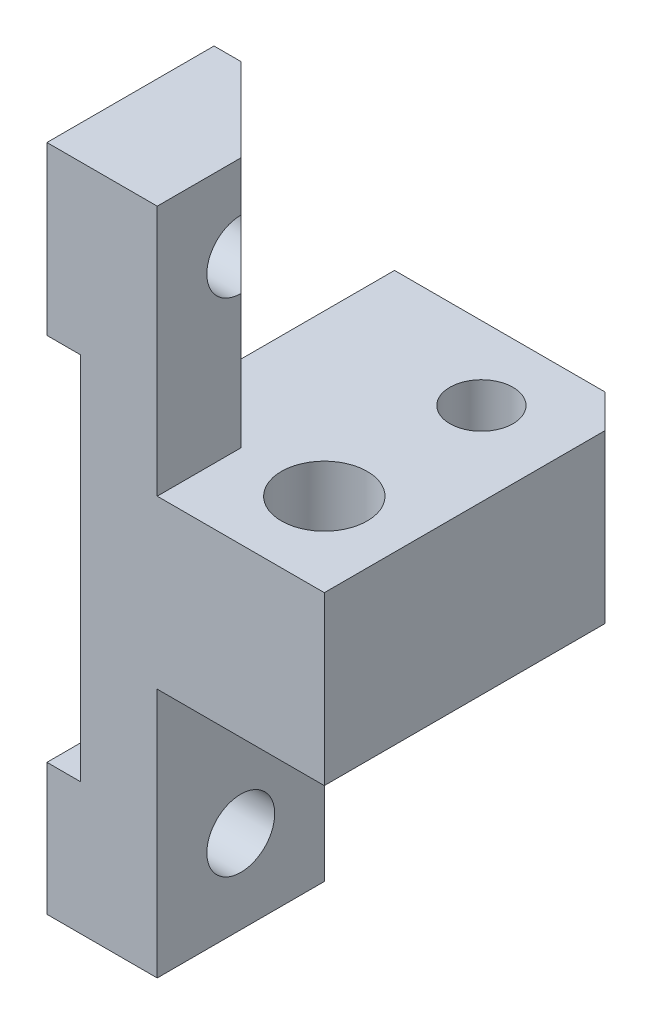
ISO-10303-21;
HEADER;
FILE_DESCRIPTION(('STEP AP214'),'2;1');
FILE_NAME('part.step','',(''),(''),'','','');
FILE_SCHEMA(('AUTOMOTIVE_DESIGN { 1 0 10303 214 1 1 1 1 }'));
ENDSEC;
DATA;
#1=APPLICATION_CONTEXT('core data for automotive mechanical design processes');
#2=APPLICATION_PROTOCOL_DEFINITION('international standard','automotive_design',2000,#1);
#3=PRODUCT_CONTEXT('',#1,'mechanical');
#4=PRODUCT('Part','Part','',(#3));
#5=PRODUCT_RELATED_PRODUCT_CATEGORY('part','',(#4));
#6=PRODUCT_DEFINITION_FORMATION('','',#4);
#7=PRODUCT_DEFINITION_CONTEXT('part definition',#1,'design');
#8=PRODUCT_DEFINITION('design','',#6,#7);
#9=PRODUCT_DEFINITION_SHAPE('','',#8);
#10=(LENGTH_UNIT() NAMED_UNIT(*) SI_UNIT(.MILLI.,.METRE.));
#11=(NAMED_UNIT(*) PLANE_ANGLE_UNIT() SI_UNIT($,.RADIAN.));
#12=(NAMED_UNIT(*) SI_UNIT($,.STERADIAN.) SOLID_ANGLE_UNIT());
#13=UNCERTAINTY_MEASURE_WITH_UNIT(LENGTH_MEASURE(1.E-05),#10,'distance_accuracy_value','');
#14=(GEOMETRIC_REPRESENTATION_CONTEXT(3) GLOBAL_UNCERTAINTY_ASSIGNED_CONTEXT((#13)) GLOBAL_UNIT_ASSIGNED_CONTEXT((#10,
#11,#12)) REPRESENTATION_CONTEXT('',''));
#15=CARTESIAN_POINT('',(0.,0.,0.));
#16=DIRECTION('',(0.,0.,1.));
#17=DIRECTION('',(1.,0.,0.));
#18=AXIS2_PLACEMENT_3D('',#15,#16,#17);
#19=CARTESIAN_POINT('',(0.,-12.7,0.));
#20=DIRECTION('',(0.,0.,1.));
#21=DIRECTION('',(1.,0.,0.));
#22=AXIS2_PLACEMENT_3D('',#19,#20,#21);
#23=PLANE('',#22);
#24=DIRECTION('',(1.,0.,0.));
#25=VECTOR('',#24,1.);
#26=CARTESIAN_POINT('',(0.,6.35,0.));
#27=LINE('',#26,#25);
#28=CARTESIAN_POINT('',(0.,6.35,0.));
#29=VERTEX_POINT('',#28);
#30=CARTESIAN_POINT('',(1.01599999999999,6.35,0.));
#31=VERTEX_POINT('',#30);
#32=EDGE_CURVE('E329',#29,#31,#27,.T.);
#33=ORIENTED_EDGE('',*,*,#32,.F.);
#34=DIRECTION('',(0.,-1.,0.));
#35=VECTOR('',#34,1.);
#36=CARTESIAN_POINT('',(0.,12.7,0.));
#37=LINE('',#36,#35);
#38=CARTESIAN_POINT('',(0.,12.7,0.));
#39=VERTEX_POINT('',#38);
#40=EDGE_CURVE('E216',#39,#29,#37,.T.);
#41=ORIENTED_EDGE('',*,*,#40,.F.);
#42=DIRECTION('',(-1.,0.,0.));
#43=VECTOR('',#42,1.);
#44=CARTESIAN_POINT('',(0.,12.7,0.));
#45=LINE('',#44,#43);
#46=CARTESIAN_POINT('',(1.01599999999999,12.7,0.));
#47=VERTEX_POINT('',#46);
#48=EDGE_CURVE('E189',#47,#39,#45,.T.);
#49=ORIENTED_EDGE('',*,*,#48,.F.);
#50=DIRECTION('',(0.,-1.,0.));
#51=VECTOR('',#50,1.);
#52=CARTESIAN_POINT('',(1.01599999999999,-12.7,0.));
#53=LINE('',#52,#51);
#54=EDGE_CURVE('E265',#47,#31,#53,.T.);
#55=ORIENTED_EDGE('',*,*,#54,.T.);
#56=EDGE_LOOP('',(#33,#41,#49,#55));
#57=FACE_BOUND('',#56,.T.);
#58=ADVANCED_FACE('F42',(#57),#23,.F.);
#59=DIRECTION('',(-1.,0.,0.));
#60=VECTOR('',#59,1.);
#61=CARTESIAN_POINT('',(0.,-7.69743289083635,0.));
#62=LINE('',#61,#60);
#63=CARTESIAN_POINT('',(1.27,-7.69743289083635,0.));
#64=VERTEX_POINT('',#63);
#65=CARTESIAN_POINT('',(0.,-7.69743289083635,0.));
#66=VERTEX_POINT('',#65);
#67=EDGE_CURVE('E170',#64,#66,#62,.T.);
#68=ORIENTED_EDGE('',*,*,#67,.F.);
#69=DIRECTION('',(0.,1.,0.));
#70=VECTOR('',#69,1.);
#71=CARTESIAN_POINT('',(1.27,-12.7,0.));
#72=LINE('',#71,#70);
#73=CARTESIAN_POINT('',(1.27,-3.194174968,0.));
#74=VERTEX_POINT('',#73);
#75=EDGE_CURVE('E327',#64,#74,#72,.T.);
#76=ORIENTED_EDGE('',*,*,#75,.T.);
#77=DIRECTION('',(-1.,0.,0.));
#78=VECTOR('',#77,1.);
#79=CARTESIAN_POINT('',(10.541,-3.194174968,0.));
#80=LINE('',#79,#78);
#81=CARTESIAN_POINT('',(4.191,-3.19417496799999,0.));
#82=VERTEX_POINT('',#81);
#83=EDGE_CURVE('E228',#82,#74,#80,.T.);
#84=ORIENTED_EDGE('',*,*,#83,.F.);
#85=DIRECTION('',(0.,1.,0.));
#86=VECTOR('',#85,1.);
#87=CARTESIAN_POINT('',(4.191,12.7,0.));
#88=LINE('',#87,#86);
#89=CARTESIAN_POINT('',(4.191,-12.7,0.));
#90=VERTEX_POINT('',#89);
#91=EDGE_CURVE('E193',#90,#82,#88,.T.);
#92=ORIENTED_EDGE('',*,*,#91,.F.);
#93=DIRECTION('',(1.,0.,0.));
#94=VECTOR('',#93,1.);
#95=CARTESIAN_POINT('',(0.,-12.7,0.));
#96=LINE('',#95,#94);
#97=CARTESIAN_POINT('',(0.,-12.7,0.));
#98=VERTEX_POINT('',#97);
#99=EDGE_CURVE('E212',#98,#90,#96,.T.);
#100=ORIENTED_EDGE('',*,*,#99,.F.);
#101=EDGE_CURVE('E46',#66,#98,#37,.T.);
#102=ORIENTED_EDGE('',*,*,#101,.F.);
#103=EDGE_LOOP('',(#68,#76,#84,#92,#100,#102));
#104=FACE_BOUND('',#103,.T.);
#105=ADVANCED_FACE('F363',(#104),#23,.F.);
#106=CARTESIAN_POINT('',(0.,12.7,6.35));
#107=DIRECTION('',(1.,0.,0.));
#108=DIRECTION('',(0.,1.,0.));
#109=AXIS2_PLACEMENT_3D('',#106,#107,#108);
#110=PLANE('',#109);
#111=CARTESIAN_POINT('',(0.,-9.525,3.17500000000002));
#112=DIRECTION('',(-1.,0.,0.));
#113=DIRECTION('',(0.,0.,1.));
#114=AXIS2_PLACEMENT_3D('',#111,#112,#113);
#115=CIRCLE('',#114,1.28904999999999);
#116=CARTESIAN_POINT('',(0.,-9.525,4.46405000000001));
#117=VERTEX_POINT('',#116);
#118=EDGE_CURVE('E334',#117,#117,#115,.T.);
#119=ORIENTED_EDGE('',*,*,#118,.F.);
#120=EDGE_LOOP('',(#119));
#121=FACE_BOUND('',#120,.T.);
#122=DIRECTION('',(0.,0.,-1.));
#123=VECTOR('',#122,1.);
#124=CARTESIAN_POINT('',(0.,-7.69743289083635,6.35));
#125=LINE('',#124,#123);
#126=CARTESIAN_POINT('',(0.,-7.69743289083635,6.35));
#127=VERTEX_POINT('',#126);
#128=EDGE_CURVE('E163',#127,#66,#125,.T.);
#129=ORIENTED_EDGE('',*,*,#128,.T.);
#130=ORIENTED_EDGE('',*,*,#101,.T.);
#131=DIRECTION('',(0.,0.,-1.));
#132=VECTOR('',#131,1.);
#133=CARTESIAN_POINT('',(0.,-12.7,6.35));
#134=LINE('',#133,#132);
#135=CARTESIAN_POINT('',(0.,-12.7,6.35));
#136=VERTEX_POINT('',#135);
#137=EDGE_CURVE('E187',#136,#98,#134,.T.);
#138=ORIENTED_EDGE('',*,*,#137,.F.);
#139=DIRECTION('',(0.,-1.,0.));
#140=VECTOR('',#139,1.);
#141=CARTESIAN_POINT('',(0.,12.7,6.35));
#142=LINE('',#141,#140);
#143=EDGE_CURVE('E178',#127,#136,#142,.T.);
#144=ORIENTED_EDGE('',*,*,#143,.F.);
#145=EDGE_LOOP('',(#129,#130,#138,#144));
#146=FACE_BOUND('',#145,.T.);
#147=ADVANCED_FACE('F44',(#121,#146),#110,.F.);
#148=CARTESIAN_POINT('',(0.,9.525,3.17500000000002));
#149=DIRECTION('',(-1.,0.,0.));
#150=DIRECTION('',(0.,0.,1.));
#151=AXIS2_PLACEMENT_3D('',#148,#149,#150);
#152=CIRCLE('',#151,1.28904999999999);
#153=CARTESIAN_POINT('',(0.,9.525,4.46405));
#154=VERTEX_POINT('',#153);
#155=EDGE_CURVE('E340',#154,#154,#152,.T.);
#156=ORIENTED_EDGE('',*,*,#155,.F.);
#157=EDGE_LOOP('',(#156));
#158=FACE_BOUND('',#157,.T.);
#159=DIRECTION('',(0.,0.,1.));
#160=VECTOR('',#159,1.);
#161=CARTESIAN_POINT('',(0.,6.35,6.35));
#162=LINE('',#161,#160);
#163=CARTESIAN_POINT('',(0.,6.35,6.35));
#164=VERTEX_POINT('',#163);
#165=EDGE_CURVE('E174',#29,#164,#162,.T.);
#166=ORIENTED_EDGE('',*,*,#165,.T.);
#167=CARTESIAN_POINT('',(0.,12.7,6.35));
#168=VERTEX_POINT('',#167);
#169=EDGE_CURVE('E188',#168,#164,#142,.T.);
#170=ORIENTED_EDGE('',*,*,#169,.F.);
#171=DIRECTION('',(0.,0.,-1.));
#172=VECTOR('',#171,1.);
#173=CARTESIAN_POINT('',(0.,12.7,6.35));
#174=LINE('',#173,#172);
#175=EDGE_CURVE('E416',#168,#39,#174,.T.);
#176=ORIENTED_EDGE('',*,*,#175,.T.);
#177=ORIENTED_EDGE('',*,*,#40,.T.);
#178=EDGE_LOOP('',(#166,#170,#176,#177));
#179=FACE_BOUND('',#178,.T.);
#180=ADVANCED_FACE('F376',(#158,#179),#110,.F.);
#181=CARTESIAN_POINT('',(0.,-12.7,6.35));
#182=DIRECTION('',(0.,0.,1.));
#183=DIRECTION('',(1.,0.,0.));
#184=AXIS2_PLACEMENT_3D('',#181,#182,#183);
#185=PLANE('',#184);
#186=DIRECTION('',(0.,-1.,0.));
#187=VECTOR('',#186,1.);
#188=CARTESIAN_POINT('',(1.27,6.35,6.35));
#189=LINE('',#188,#187);
#190=CARTESIAN_POINT('',(1.27,6.35,6.35));
#191=VERTEX_POINT('',#190);
#192=CARTESIAN_POINT('',(1.27,-7.69743289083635,6.35));
#193=VERTEX_POINT('',#192);
#194=EDGE_CURVE('E181',#191,#193,#189,.T.);
#195=ORIENTED_EDGE('',*,*,#194,.T.);
#196=DIRECTION('',(-1.,0.,0.));
#197=VECTOR('',#196,1.);
#198=CARTESIAN_POINT('',(1.27,-7.69743289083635,6.35));
#199=LINE('',#198,#197);
#200=EDGE_CURVE('E167',#193,#127,#199,.T.);
#201=ORIENTED_EDGE('',*,*,#200,.T.);
#202=ORIENTED_EDGE('',*,*,#143,.T.);
#203=DIRECTION('',(1.,0.,0.));
#204=VECTOR('',#203,1.);
#205=CARTESIAN_POINT('',(0.,-12.7,6.35));
#206=LINE('',#205,#204);
#207=CARTESIAN_POINT('',(4.191,-12.7,6.35));
#208=VERTEX_POINT('',#207);
#209=EDGE_CURVE('E192',#136,#208,#206,.T.);
#210=ORIENTED_EDGE('',*,*,#209,.T.);
#211=DIRECTION('',(0.,1.,0.));
#212=VECTOR('',#211,1.);
#213=CARTESIAN_POINT('',(4.191,12.7,6.35));
#214=LINE('',#213,#212);
#215=CARTESIAN_POINT('',(4.191,-3.19417496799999,6.35));
#216=VERTEX_POINT('',#215);
#217=EDGE_CURVE('E207',#208,#216,#214,.T.);
#218=ORIENTED_EDGE('',*,*,#217,.T.);
#219=DIRECTION('',(-1.,0.,0.));
#220=VECTOR('',#219,1.);
#221=CARTESIAN_POINT('',(10.541,-3.194174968,6.35));
#222=LINE('',#221,#220);
#223=CARTESIAN_POINT('',(10.541,-3.194174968,6.35));
#224=VERTEX_POINT('',#223);
#225=EDGE_CURVE('E298',#224,#216,#222,.T.);
#226=ORIENTED_EDGE('',*,*,#225,.F.);
#227=DIRECTION('',(0.,-1.,0.));
#228=VECTOR('',#227,1.);
#229=CARTESIAN_POINT('',(10.541,-3.194174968,6.35));
#230=LINE('',#229,#228);
#231=CARTESIAN_POINT('',(10.541,3.155825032,6.35));
#232=VERTEX_POINT('',#231);
#233=EDGE_CURVE('E300',#232,#224,#230,.T.);
#234=ORIENTED_EDGE('',*,*,#233,.F.);
#235=DIRECTION('',(-1.,0.,0.));
#236=VECTOR('',#235,1.);
#237=CARTESIAN_POINT('',(10.541,3.155825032,6.35));
#238=LINE('',#237,#236);
#239=CARTESIAN_POINT('',(4.191,3.155825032,6.35));
#240=VERTEX_POINT('',#239);
#241=EDGE_CURVE('E294',#232,#240,#238,.T.);
#242=ORIENTED_EDGE('',*,*,#241,.T.);
#243=CARTESIAN_POINT('',(4.191,12.7,6.35));
#244=VERTEX_POINT('',#243);
#245=EDGE_CURVE('E198',#240,#244,#214,.T.);
#246=ORIENTED_EDGE('',*,*,#245,.T.);
#247=DIRECTION('',(-1.,0.,0.));
#248=VECTOR('',#247,1.);
#249=CARTESIAN_POINT('',(0.,12.7,6.35));
#250=LINE('',#249,#248);
#251=EDGE_CURVE('E201',#244,#168,#250,.T.);
#252=ORIENTED_EDGE('',*,*,#251,.T.);
#253=ORIENTED_EDGE('',*,*,#169,.T.);
#254=DIRECTION('',(-1.,0.,0.));
#255=VECTOR('',#254,1.);
#256=CARTESIAN_POINT('',(1.27,6.35,6.35));
#257=LINE('',#256,#255);
#258=EDGE_CURVE('E183',#191,#164,#257,.T.);
#259=ORIENTED_EDGE('',*,*,#258,.F.);
#260=EDGE_LOOP('',(#195,#201,#202,#210,#218,#226,#234,#242,#246,#252,#253,#259));
#261=FACE_BOUND('',#260,.T.);
#262=ADVANCED_FACE('F177',(#261),#185,.T.);
#263=CARTESIAN_POINT('',(4.191,12.7,3.175));
#264=DIRECTION('',(-0.707106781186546,0.,0.707106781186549));
#265=DIRECTION('',(0.707106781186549,0.,0.707106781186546));
#266=AXIS2_PLACEMENT_3D('',#263,#264,#265);
#267=PLANE('',#266);
#268=DIRECTION('',(0.,1.,0.));
#269=VECTOR('',#268,1.);
#270=CARTESIAN_POINT('',(1.27,12.7,0.254000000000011));
#271=LINE('',#270,#269);
#272=CARTESIAN_POINT('',(1.27,6.35,0.254000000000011));
#273=VERTEX_POINT('',#272);
#274=CARTESIAN_POINT('',(1.27,3.155825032,0.254000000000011));
#275=VERTEX_POINT('',#274);
#276=EDGE_CURVE('E52',#273,#275,#271,.F.);
#277=ORIENTED_EDGE('',*,*,#276,.F.);
#278=DIRECTION('',(0.707106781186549,0.,0.707106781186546));
#279=VECTOR('',#278,1.);
#280=CARTESIAN_POINT('',(4.191,6.35,3.175));
#281=LINE('',#280,#279);
#282=EDGE_CURVE('E13',#273,#31,#281,.F.);
#283=ORIENTED_EDGE('',*,*,#282,.T.);
#284=ORIENTED_EDGE('',*,*,#54,.F.);
#285=DIRECTION('',(0.707106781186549,0.,0.707106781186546));
#286=VECTOR('',#285,1.);
#287=CARTESIAN_POINT('',(4.191,12.7,3.175));
#288=LINE('',#287,#286);
#289=CARTESIAN_POINT('',(4.191,12.7,3.175));
#290=VERTEX_POINT('',#289);
#291=EDGE_CURVE('E262',#290,#47,#288,.F.);
#292=ORIENTED_EDGE('',*,*,#291,.F.);
#293=DIRECTION('',(0.,1.,0.));
#294=VECTOR('',#293,1.);
#295=CARTESIAN_POINT('',(4.191,12.7,3.175));
#296=LINE('',#295,#294);
#297=CARTESIAN_POINT('',(4.191,10.81405,3.175));
#298=VERTEX_POINT('',#297);
#299=EDGE_CURVE('E263',#298,#290,#296,.T.);
#300=ORIENTED_EDGE('',*,*,#299,.F.);
#301=CARTESIAN_POINT('',(4.19100000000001,9.525,3.17500000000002));
#302=DIRECTION('',(-0.707106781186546,0.,0.707106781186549));
#303=DIRECTION('',(-0.707106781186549,0.,-0.707106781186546));
#304=AXIS2_PLACEMENT_3D('',#301,#302,#303);
#305=ELLIPSE('',#304,1.82299199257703,1.28904999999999);
#306=CARTESIAN_POINT('',(4.191,8.23595000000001,3.175));
#307=VERTEX_POINT('',#306);
#308=EDGE_CURVE('E286',#307,#298,#305,.F.);
#309=ORIENTED_EDGE('',*,*,#308,.F.);
#310=CARTESIAN_POINT('',(4.191,3.155825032,3.175));
#311=VERTEX_POINT('',#310);
#312=EDGE_CURVE('E259',#311,#307,#296,.T.);
#313=ORIENTED_EDGE('',*,*,#312,.F.);
#314=DIRECTION('',(-0.707106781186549,0.,-0.707106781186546));
#315=VECTOR('',#314,1.);
#316=CARTESIAN_POINT('',(5.77850000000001,3.155825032,4.7625));
#317=LINE('',#316,#315);
#318=EDGE_CURVE('E268',#275,#311,#317,.F.);
#319=ORIENTED_EDGE('',*,*,#318,.F.);
#320=EDGE_LOOP('',(#277,#283,#284,#292,#300,#309,#313,#319));
#321=FACE_BOUND('',#320,.T.);
#322=ADVANCED_FACE('F284',(#321),#267,.F.);
#323=CARTESIAN_POINT('',(4.191,12.7,6.35));
#324=DIRECTION('',(-1.,0.,0.));
#325=DIRECTION('',(0.,-1.,0.));
#326=AXIS2_PLACEMENT_3D('',#323,#324,#325);
#327=PLANE('',#326);
#328=CARTESIAN_POINT('',(4.191,-9.525,3.17500000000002));
#329=DIRECTION('',(-1.,0.,0.));
#330=DIRECTION('',(0.,-1.,0.));
#331=AXIS2_PLACEMENT_3D('',#328,#329,#330);
#332=CIRCLE('',#331,1.28904999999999);
#333=CARTESIAN_POINT('',(4.191,-10.81405,3.17500000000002));
#334=VERTEX_POINT('',#333);
#335=EDGE_CURVE('E337',#334,#334,#332,.T.);
#336=ORIENTED_EDGE('',*,*,#335,.T.);
#337=EDGE_LOOP('',(#336));
#338=FACE_BOUND('',#337,.T.);
#339=DIRECTION('',(0.,0.,-1.));
#340=VECTOR('',#339,1.);
#341=CARTESIAN_POINT('',(4.191,-3.194174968,0.));
#342=LINE('',#341,#340);
#343=EDGE_CURVE('E256',#216,#82,#342,.T.);
#344=ORIENTED_EDGE('',*,*,#343,.F.);
#345=ORIENTED_EDGE('',*,*,#217,.F.);
#346=DIRECTION('',(0.,0.,-1.));
#347=VECTOR('',#346,1.);
#348=CARTESIAN_POINT('',(4.191,-12.7,6.35));
#349=LINE('',#348,#347);
#350=EDGE_CURVE('E393',#208,#90,#349,.T.);
#351=ORIENTED_EDGE('',*,*,#350,.T.);
#352=ORIENTED_EDGE('',*,*,#91,.T.);
#353=EDGE_LOOP('',(#344,#345,#351,#352));
#354=FACE_BOUND('',#353,.T.);
#355=ADVANCED_FACE('F382',(#338,#354),#327,.F.);
#356=ORIENTED_EDGE('',*,*,#312,.T.);
#357=CARTESIAN_POINT('',(4.191,9.525,3.17500000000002));
#358=DIRECTION('',(-1.,0.,0.));
#359=DIRECTION('',(0.,-1.,0.));
#360=AXIS2_PLACEMENT_3D('',#357,#358,#359);
#361=CIRCLE('',#360,1.28904999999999);
#362=EDGE_CURVE('E66',#307,#298,#361,.T.);
#363=ORIENTED_EDGE('',*,*,#362,.T.);
#364=ORIENTED_EDGE('',*,*,#299,.T.);
#365=DIRECTION('',(0.,0.,-1.));
#366=VECTOR('',#365,1.);
#367=CARTESIAN_POINT('',(4.191,12.7,6.35));
#368=LINE('',#367,#366);
#369=EDGE_CURVE('E397',#244,#290,#368,.T.);
#370=ORIENTED_EDGE('',*,*,#369,.F.);
#371=ORIENTED_EDGE('',*,*,#245,.F.);
#372=DIRECTION('',(0.,0.,1.));
#373=VECTOR('',#372,1.);
#374=CARTESIAN_POINT('',(4.191,3.155825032,0.));
#375=LINE('',#374,#373);
#376=EDGE_CURVE('E253',#311,#240,#375,.T.);
#377=ORIENTED_EDGE('',*,*,#376,.F.);
#378=EDGE_LOOP('',(#356,#363,#364,#370,#371,#377));
#379=FACE_BOUND('',#378,.T.);
#380=ADVANCED_FACE('F288',(#379),#327,.F.);
#381=CARTESIAN_POINT('',(0.,-12.7,6.35));
#382=DIRECTION('',(0.,1.,0.));
#383=DIRECTION('',(0.,0.,1.));
#384=AXIS2_PLACEMENT_3D('',#381,#382,#383);
#385=PLANE('',#384);
#386=ORIENTED_EDGE('',*,*,#99,.T.);
#387=ORIENTED_EDGE('',*,*,#350,.F.);
#388=ORIENTED_EDGE('',*,*,#209,.F.);
#389=ORIENTED_EDGE('',*,*,#137,.T.);
#390=EDGE_LOOP('',(#386,#387,#388,#389));
#391=FACE_BOUND('',#390,.T.);
#392=ADVANCED_FACE('F380',(#391),#385,.F.);
#393=CARTESIAN_POINT('',(0.,12.7,6.35));
#394=DIRECTION('',(0.,-1.,0.));
#395=DIRECTION('',(1.,0.,0.));
#396=AXIS2_PLACEMENT_3D('',#393,#394,#395);
#397=PLANE('',#396);
#398=ORIENTED_EDGE('',*,*,#369,.T.);
#399=ORIENTED_EDGE('',*,*,#291,.T.);
#400=ORIENTED_EDGE('',*,*,#48,.T.);
#401=ORIENTED_EDGE('',*,*,#175,.F.);
#402=ORIENTED_EDGE('',*,*,#251,.F.);
#403=EDGE_LOOP('',(#398,#399,#400,#401,#402));
#404=FACE_BOUND('',#403,.T.);
#405=ADVANCED_FACE('F377',(#404),#397,.F.);
#406=CARTESIAN_POINT('',(10.541,3.155825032,0.));
#407=DIRECTION('',(0.,-1.,0.));
#408=DIRECTION('',(1.,0.,0.));
#409=AXIS2_PLACEMENT_3D('',#406,#407,#408);
#410=PLANE('',#409);
#411=CARTESIAN_POINT('',(7.366,3.155825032,-2.794));
#412=DIRECTION('',(0.,1.,0.));
#413=DIRECTION('',(0.,0.,1.));
#414=AXIS2_PLACEMENT_3D('',#411,#412,#413);
#415=CIRCLE('',#414,1.20015);
#416=CARTESIAN_POINT('',(7.366,3.155825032,-1.59385));
#417=VERTEX_POINT('',#416);
#418=EDGE_CURVE('E238',#417,#417,#415,.T.);
#419=ORIENTED_EDGE('',*,*,#418,.F.);
#420=EDGE_LOOP('',(#419));
#421=FACE_BOUND('',#420,.T.);
#422=CARTESIAN_POINT('',(7.366,3.155825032,3.175));
#423=DIRECTION('',(0.,1.,0.));
#424=DIRECTION('',(0.,0.,1.));
#425=AXIS2_PLACEMENT_3D('',#422,#423,#424);
#426=CIRCLE('',#425,1.63194999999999);
#427=CARTESIAN_POINT('',(7.366,3.155825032,4.80694999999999));
#428=VERTEX_POINT('',#427);
#429=EDGE_CURVE('E245',#428,#428,#426,.T.);
#430=ORIENTED_EDGE('',*,*,#429,.F.);
#431=EDGE_LOOP('',(#430));
#432=FACE_BOUND('',#431,.T.);
#433=DIRECTION('',(1.,0.,0.));
#434=VECTOR('',#433,1.);
#435=CARTESIAN_POINT('',(10.541,3.155825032,-5.588));
#436=LINE('',#435,#434);
#437=CARTESIAN_POINT('',(1.27,3.155825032,-5.588));
#438=VERTEX_POINT('',#437);
#439=CARTESIAN_POINT('',(9.271,3.155825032,-5.588));
#440=VERTEX_POINT('',#439);
#441=EDGE_CURVE('E243',#438,#440,#436,.T.);
#442=ORIENTED_EDGE('',*,*,#441,.F.);
#443=DIRECTION('',(0.,0.,1.));
#444=VECTOR('',#443,1.);
#445=CARTESIAN_POINT('',(1.27,3.155825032,0.));
#446=LINE('',#445,#444);
#447=EDGE_CURVE('E182',#438,#275,#446,.T.);
#448=ORIENTED_EDGE('',*,*,#447,.T.);
#449=ORIENTED_EDGE('',*,*,#318,.T.);
#450=ORIENTED_EDGE('',*,*,#376,.T.);
#451=ORIENTED_EDGE('',*,*,#241,.F.);
#452=DIRECTION('',(0.,0.,1.));
#453=VECTOR('',#452,1.);
#454=CARTESIAN_POINT('',(10.541,3.155825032,0.));
#455=LINE('',#454,#453);
#456=CARTESIAN_POINT('',(10.541,3.155825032,-4.318));
#457=VERTEX_POINT('',#456);
#458=EDGE_CURVE('E296',#457,#232,#455,.T.);
#459=ORIENTED_EDGE('',*,*,#458,.F.);
#460=DIRECTION('',(0.707106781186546,0.,0.707106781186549));
#461=VECTOR('',#460,1.);
#462=CARTESIAN_POINT('',(9.271,3.155825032,-5.588));
#463=LINE('',#462,#461);
#464=EDGE_CURVE('E257',#457,#440,#463,.F.);
#465=ORIENTED_EDGE('',*,*,#464,.T.);
#466=EDGE_LOOP('',(#442,#448,#449,#450,#451,#459,#465));
#467=FACE_BOUND('',#466,.T.);
#468=ADVANCED_FACE('F278',(#421,#432,#467),#410,.F.);
#469=CARTESIAN_POINT('',(10.541,-3.194174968,0.));
#470=DIRECTION('',(0.,1.,0.));
#471=DIRECTION('',(-1.,0.,0.));
#472=AXIS2_PLACEMENT_3D('',#469,#470,#471);
#473=PLANE('',#472);
#474=CARTESIAN_POINT('',(7.366,-3.194174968,-2.794));
#475=DIRECTION('',(0.,1.,0.));
#476=DIRECTION('',(-1.,0.,0.));
#477=AXIS2_PLACEMENT_3D('',#474,#475,#476);
#478=CIRCLE('',#477,1.20015);
#479=CARTESIAN_POINT('',(6.16585,-3.194174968,-2.794));
#480=VERTEX_POINT('',#479);
#481=EDGE_CURVE('E233',#480,#480,#478,.T.);
#482=ORIENTED_EDGE('',*,*,#481,.T.);
#483=EDGE_LOOP('',(#482));
#484=FACE_BOUND('',#483,.T.);
#485=CARTESIAN_POINT('',(7.366,-3.194174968,3.175));
#486=DIRECTION('',(0.,1.,0.));
#487=DIRECTION('',(-1.,0.,0.));
#488=AXIS2_PLACEMENT_3D('',#485,#486,#487);
#489=CIRCLE('',#488,1.63194999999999);
#490=CARTESIAN_POINT('',(5.73405000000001,-3.194174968,3.175));
#491=VERTEX_POINT('',#490);
#492=EDGE_CURVE('E226',#491,#491,#489,.T.);
#493=ORIENTED_EDGE('',*,*,#492,.T.);
#494=EDGE_LOOP('',(#493));
#495=FACE_BOUND('',#494,.T.);
#496=ORIENTED_EDGE('',*,*,#83,.T.);
#497=DIRECTION('',(0.,0.,-1.));
#498=VECTOR('',#497,1.);
#499=CARTESIAN_POINT('',(1.27,-3.194174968,0.));
#500=LINE('',#499,#498);
#501=CARTESIAN_POINT('',(1.27,-3.194174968,-5.588));
#502=VERTEX_POINT('',#501);
#503=EDGE_CURVE('E281',#74,#502,#500,.T.);
#504=ORIENTED_EDGE('',*,*,#503,.T.);
#505=DIRECTION('',(-1.,0.,0.));
#506=VECTOR('',#505,1.);
#507=CARTESIAN_POINT('',(10.541,-3.194174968,-5.588));
#508=LINE('',#507,#506);
#509=CARTESIAN_POINT('',(9.271,-3.194174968,-5.588));
#510=VERTEX_POINT('',#509);
#511=EDGE_CURVE('E240',#510,#502,#508,.T.);
#512=ORIENTED_EDGE('',*,*,#511,.F.);
#513=DIRECTION('',(-0.707106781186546,0.,-0.707106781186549));
#514=VECTOR('',#513,1.);
#515=CARTESIAN_POINT('',(9.271,-3.194174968,-5.588));
#516=LINE('',#515,#514);
#517=CARTESIAN_POINT('',(10.541,-3.194174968,-4.318));
#518=VERTEX_POINT('',#517);
#519=EDGE_CURVE('E314',#510,#518,#516,.F.);
#520=ORIENTED_EDGE('',*,*,#519,.T.);
#521=DIRECTION('',(0.,0.,-1.));
#522=VECTOR('',#521,1.);
#523=CARTESIAN_POINT('',(10.541,-3.194174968,0.));
#524=LINE('',#523,#522);
#525=EDGE_CURVE('E219',#224,#518,#524,.T.);
#526=ORIENTED_EDGE('',*,*,#525,.F.);
#527=ORIENTED_EDGE('',*,*,#225,.T.);
#528=ORIENTED_EDGE('',*,*,#343,.T.);
#529=EDGE_LOOP('',(#496,#504,#512,#520,#526,#527,#528));
#530=FACE_BOUND('',#529,.T.);
#531=ADVANCED_FACE('F312',(#484,#495,#530),#473,.F.);
#532=CARTESIAN_POINT('',(10.541,3.155825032,0.));
#533=DIRECTION('',(1.,0.,0.));
#534=DIRECTION('',(0.,1.,0.));
#535=AXIS2_PLACEMENT_3D('',#532,#533,#534);
#536=PLANE('',#535);
#537=ORIENTED_EDGE('',*,*,#525,.T.);
#538=DIRECTION('',(0.,1.,0.));
#539=VECTOR('',#538,1.);
#540=CARTESIAN_POINT('',(10.541,3.155825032,-4.318));
#541=LINE('',#540,#539);
#542=EDGE_CURVE('E317',#518,#457,#541,.T.);
#543=ORIENTED_EDGE('',*,*,#542,.T.);
#544=ORIENTED_EDGE('',*,*,#458,.T.);
#545=ORIENTED_EDGE('',*,*,#233,.T.);
#546=EDGE_LOOP('',(#537,#543,#544,#545));
#547=FACE_BOUND('',#546,.T.);
#548=ADVANCED_FACE('F316',(#547),#536,.T.);
#549=CARTESIAN_POINT('',(7.366,3.155825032,3.175));
#550=DIRECTION('',(0.,1.,0.));
#551=DIRECTION('',(0.,0.,1.));
#552=AXIS2_PLACEMENT_3D('',#549,#550,#551);
#553=CYLINDRICAL_SURFACE('',#552,1.63194999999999);
#554=ORIENTED_EDGE('',*,*,#429,.T.);
#555=EDGE_LOOP('',(#554));
#556=FACE_BOUND('',#555,.T.);
#557=ORIENTED_EDGE('',*,*,#492,.F.);
#558=EDGE_LOOP('',(#557));
#559=FACE_BOUND('',#558,.T.);
#560=ADVANCED_FACE('F360',(#556,#559),#553,.F.);
#561=CARTESIAN_POINT('',(10.541,-3.194174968,-5.588));
#562=DIRECTION('',(0.,0.,-1.));
#563=DIRECTION('',(-1.,0.,0.));
#564=AXIS2_PLACEMENT_3D('',#561,#562,#563);
#565=PLANE('',#564);
#566=DIRECTION('',(0.,1.,0.));
#567=VECTOR('',#566,1.);
#568=CARTESIAN_POINT('',(1.27,6.35,-5.588));
#569=LINE('',#568,#567);
#570=EDGE_CURVE('E399',#502,#438,#569,.T.);
#571=ORIENTED_EDGE('',*,*,#570,.T.);
#572=ORIENTED_EDGE('',*,*,#441,.T.);
#573=DIRECTION('',(0.,-1.,0.));
#574=VECTOR('',#573,1.);
#575=CARTESIAN_POINT('',(9.271,-3.194174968,-5.588));
#576=LINE('',#575,#574);
#577=EDGE_CURVE('E232',#440,#510,#576,.T.);
#578=ORIENTED_EDGE('',*,*,#577,.T.);
#579=ORIENTED_EDGE('',*,*,#511,.T.);
#580=EDGE_LOOP('',(#571,#572,#578,#579));
#581=FACE_BOUND('',#580,.T.);
#582=ADVANCED_FACE('F324',(#581),#565,.T.);
#583=CARTESIAN_POINT('',(7.366,3.155825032,-2.794));
#584=DIRECTION('',(0.,1.,0.));
#585=DIRECTION('',(0.,0.,1.));
#586=AXIS2_PLACEMENT_3D('',#583,#584,#585);
#587=CYLINDRICAL_SURFACE('',#586,1.20015);
#588=ORIENTED_EDGE('',*,*,#418,.T.);
#589=EDGE_LOOP('',(#588));
#590=FACE_BOUND('',#589,.T.);
#591=ORIENTED_EDGE('',*,*,#481,.F.);
#592=EDGE_LOOP('',(#591));
#593=FACE_BOUND('',#592,.T.);
#594=ADVANCED_FACE('F351',(#590,#593),#587,.F.);
#595=CARTESIAN_POINT('',(9.271,-3.194174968,-5.588));
#596=DIRECTION('',(-0.707106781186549,0.,0.707106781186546));
#597=DIRECTION('',(0.707106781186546,0.,0.707106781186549));
#598=AXIS2_PLACEMENT_3D('',#595,#596,#597);
#599=PLANE('',#598);
#600=ORIENTED_EDGE('',*,*,#464,.F.);
#601=ORIENTED_EDGE('',*,*,#542,.F.);
#602=ORIENTED_EDGE('',*,*,#519,.F.);
#603=ORIENTED_EDGE('',*,*,#577,.F.);
#604=EDGE_LOOP('',(#600,#601,#602,#603));
#605=FACE_BOUND('',#604,.T.);
#606=ADVANCED_FACE('F319',(#605),#599,.F.);
#607=CARTESIAN_POINT('',(0.,9.525,3.17500000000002));
#608=DIRECTION('',(-1.,0.,0.));
#609=DIRECTION('',(0.,0.,1.));
#610=AXIS2_PLACEMENT_3D('',#607,#608,#609);
#611=CYLINDRICAL_SURFACE('',#610,1.28904999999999);
#612=ORIENTED_EDGE('',*,*,#155,.T.);
#613=EDGE_LOOP('',(#612));
#614=FACE_BOUND('',#613,.T.);
#615=ORIENTED_EDGE('',*,*,#308,.T.);
#616=ORIENTED_EDGE('',*,*,#362,.F.);
#617=EDGE_LOOP('',(#615,#616));
#618=FACE_BOUND('',#617,.T.);
#619=ADVANCED_FACE('F358',(#614,#618),#611,.F.);
#620=CARTESIAN_POINT('',(0.,-9.525,3.17500000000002));
#621=DIRECTION('',(-1.,0.,0.));
#622=DIRECTION('',(0.,0.,1.));
#623=AXIS2_PLACEMENT_3D('',#620,#621,#622);
#624=CYLINDRICAL_SURFACE('',#623,1.28904999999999);
#625=ORIENTED_EDGE('',*,*,#118,.T.);
#626=EDGE_LOOP('',(#625));
#627=FACE_BOUND('',#626,.T.);
#628=ORIENTED_EDGE('',*,*,#335,.F.);
#629=EDGE_LOOP('',(#628));
#630=FACE_BOUND('',#629,.T.);
#631=ADVANCED_FACE('F430',(#627,#630),#624,.F.);
#632=CARTESIAN_POINT('',(1.27,-7.69743289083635,6.35));
#633=DIRECTION('',(0.,1.,0.));
#634=DIRECTION('',(-1.,0.,0.));
#635=AXIS2_PLACEMENT_3D('',#632,#633,#634);
#636=PLANE('',#635);
#637=ORIENTED_EDGE('',*,*,#67,.T.);
#638=ORIENTED_EDGE('',*,*,#128,.F.);
#639=ORIENTED_EDGE('',*,*,#200,.F.);
#640=DIRECTION('',(0.,0.,-1.));
#641=VECTOR('',#640,1.);
#642=CARTESIAN_POINT('',(1.27,-7.69743289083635,6.35));
#643=LINE('',#642,#641);
#644=EDGE_CURVE('E398',#193,#64,#643,.T.);
#645=ORIENTED_EDGE('',*,*,#644,.T.);
#646=EDGE_LOOP('',(#637,#638,#639,#645));
#647=FACE_BOUND('',#646,.T.);
#648=ADVANCED_FACE('F165',(#647),#636,.T.);
#649=CARTESIAN_POINT('',(1.27,6.35,6.35));
#650=DIRECTION('',(0.,-1.,0.));
#651=DIRECTION('',(1.,0.,0.));
#652=AXIS2_PLACEMENT_3D('',#649,#650,#651);
#653=PLANE('',#652);
#654=ORIENTED_EDGE('',*,*,#32,.T.);
#655=ORIENTED_EDGE('',*,*,#282,.F.);
#656=DIRECTION('',(0.,0.,1.));
#657=VECTOR('',#656,1.);
#658=CARTESIAN_POINT('',(1.27,6.35,6.35));
#659=LINE('',#658,#657);
#660=EDGE_CURVE('E59',#273,#191,#659,.T.);
#661=ORIENTED_EDGE('',*,*,#660,.T.);
#662=ORIENTED_EDGE('',*,*,#258,.T.);
#663=ORIENTED_EDGE('',*,*,#165,.F.);
#664=EDGE_LOOP('',(#654,#655,#661,#662,#663));
#665=FACE_BOUND('',#664,.T.);
#666=ADVANCED_FACE('F408',(#665),#653,.T.);
#667=CARTESIAN_POINT('',(1.27,-7.69743289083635,6.35));
#668=DIRECTION('',(1.,0.,0.));
#669=DIRECTION('',(0.,1.,0.));
#670=AXIS2_PLACEMENT_3D('',#667,#668,#669);
#671=PLANE('',#670);
#672=ORIENTED_EDGE('',*,*,#644,.F.);
#673=ORIENTED_EDGE('',*,*,#194,.F.);
#674=ORIENTED_EDGE('',*,*,#660,.F.);
#675=ORIENTED_EDGE('',*,*,#276,.T.);
#676=ORIENTED_EDGE('',*,*,#447,.F.);
#677=ORIENTED_EDGE('',*,*,#570,.F.);
#678=ORIENTED_EDGE('',*,*,#503,.F.);
#679=ORIENTED_EDGE('',*,*,#75,.F.);
#680=EDGE_LOOP('',(#672,#673,#674,#675,#676,#677,#678,#679));
#681=FACE_BOUND('',#680,.T.);
#682=ADVANCED_FACE('F272',(#681),#671,.F.);
#683=CLOSED_SHELL('',(#58,#105,#147,#180,#262,#322,#355,#380,#392,#405,#468,#531,#548,#560,#582,
#594,#606,#619,#631,#648,#666,#682));
#684=MANIFOLD_SOLID_BREP('B2',#683);
#685=ADVANCED_BREP_SHAPE_REPRESENTATION('',(#18,#684),#14);
#686=SHAPE_DEFINITION_REPRESENTATION(#9,#685);
ENDSEC;
END-ISO-10303-21;
